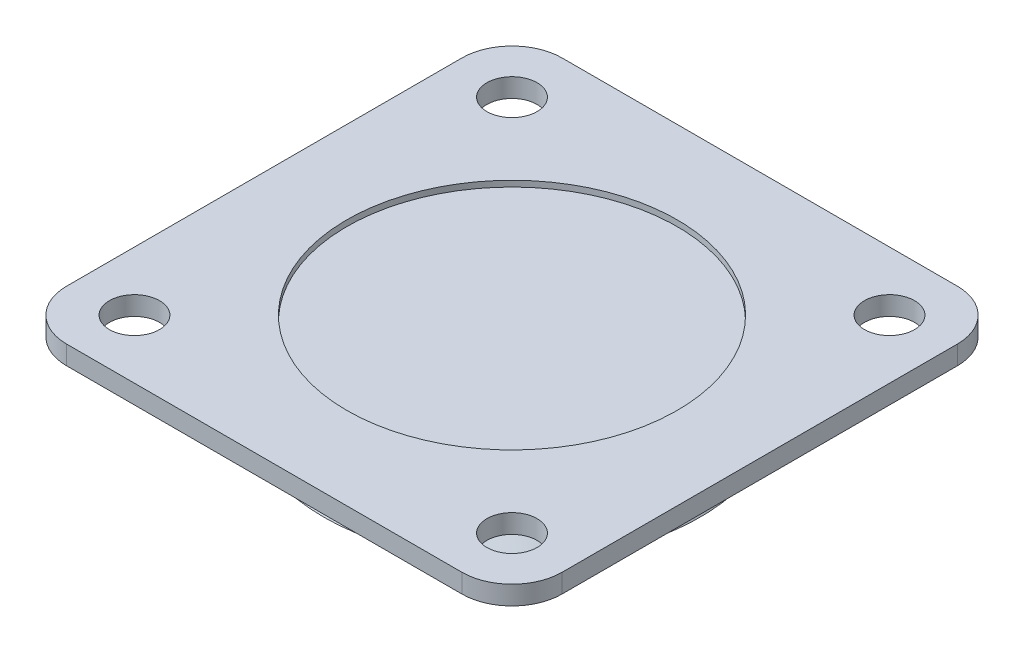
ISO-10303-21;
HEADER;
FILE_DESCRIPTION(('STEP AP214'),'2;1');
FILE_NAME('part.step','',(''),(''),'','','');
FILE_SCHEMA(('AUTOMOTIVE_DESIGN { 1 0 10303 214 1 1 1 1 }'));
ENDSEC;
DATA;
#1=APPLICATION_CONTEXT('core data for automotive mechanical design processes');
#2=APPLICATION_PROTOCOL_DEFINITION('international standard','automotive_design',2000,#1);
#3=PRODUCT_CONTEXT('',#1,'mechanical');
#4=PRODUCT('Part','Part','',(#3));
#5=PRODUCT_RELATED_PRODUCT_CATEGORY('part','',(#4));
#6=PRODUCT_DEFINITION_FORMATION('','',#4);
#7=PRODUCT_DEFINITION_CONTEXT('part definition',#1,'design');
#8=PRODUCT_DEFINITION('design','',#6,#7);
#9=PRODUCT_DEFINITION_SHAPE('','',#8);
#10=(LENGTH_UNIT() NAMED_UNIT(*) SI_UNIT(.MILLI.,.METRE.));
#11=(NAMED_UNIT(*) PLANE_ANGLE_UNIT() SI_UNIT($,.RADIAN.));
#12=(NAMED_UNIT(*) SI_UNIT($,.STERADIAN.) SOLID_ANGLE_UNIT());
#13=UNCERTAINTY_MEASURE_WITH_UNIT(LENGTH_MEASURE(1.E-05),#10,'distance_accuracy_value','');
#14=(GEOMETRIC_REPRESENTATION_CONTEXT(3) GLOBAL_UNCERTAINTY_ASSIGNED_CONTEXT((#13)) GLOBAL_UNIT_ASSIGNED_CONTEXT((#10,
#11,#12)) REPRESENTATION_CONTEXT('',''));
#15=CARTESIAN_POINT('',(0.,0.,0.));
#16=DIRECTION('',(0.,0.,1.));
#17=DIRECTION('',(1.,0.,0.));
#18=AXIS2_PLACEMENT_3D('',#15,#16,#17);
#19=CARTESIAN_POINT('',(-33.5,-3.2,-33.5));
#20=DIRECTION('',(0.,1.,0.));
#21=DIRECTION('',(0.,0.,1.));
#22=AXIS2_PLACEMENT_3D('',#19,#20,#21);
#23=PLANE('',#22);
#24=CARTESIAN_POINT('',(-33.5,-3.2,-33.5));
#25=DIRECTION('',(0.,1.,0.));
#26=DIRECTION('',(0.,0.,1.));
#27=AXIS2_PLACEMENT_3D('',#24,#25,#26);
#28=CIRCLE('',#27,8.50000000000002);
#29=CARTESIAN_POINT('',(-33.5,-3.2,-42.));
#30=VERTEX_POINT('',#29);
#31=CARTESIAN_POINT('',(-42.,-3.2,-33.5));
#32=VERTEX_POINT('',#31);
#33=EDGE_CURVE('E152',#30,#32,#28,.T.);
#34=ORIENTED_EDGE('',*,*,#33,.F.);
#35=DIRECTION('',(-1.,0.,0.));
#36=VECTOR('',#35,1.);
#37=CARTESIAN_POINT('',(33.5,-3.2,-42.));
#38=LINE('',#37,#36);
#39=CARTESIAN_POINT('',(33.5,-3.2,-42.));
#40=VERTEX_POINT('',#39);
#41=EDGE_CURVE('E120',#40,#30,#38,.T.);
#42=ORIENTED_EDGE('',*,*,#41,.F.);
#43=CARTESIAN_POINT('',(33.5,-3.2,-33.5));
#44=DIRECTION('',(0.,1.,0.));
#45=DIRECTION('',(0.,0.,1.));
#46=AXIS2_PLACEMENT_3D('',#43,#44,#45);
#47=CIRCLE('',#46,8.50000000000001);
#48=CARTESIAN_POINT('',(42.,-3.2,-33.5));
#49=VERTEX_POINT('',#48);
#50=EDGE_CURVE('E105',#49,#40,#47,.T.);
#51=ORIENTED_EDGE('',*,*,#50,.F.);
#52=DIRECTION('',(0.,0.,-1.));
#53=VECTOR('',#52,1.);
#54=CARTESIAN_POINT('',(42.,-3.2,33.5));
#55=LINE('',#54,#53);
#56=CARTESIAN_POINT('',(42.,-3.2,33.5));
#57=VERTEX_POINT('',#56);
#58=EDGE_CURVE('E118',#57,#49,#55,.T.);
#59=ORIENTED_EDGE('',*,*,#58,.F.);
#60=CARTESIAN_POINT('',(33.5,-3.2,33.5));
#61=DIRECTION('',(0.,1.,0.));
#62=DIRECTION('',(0.,0.,1.));
#63=AXIS2_PLACEMENT_3D('',#60,#61,#62);
#64=CIRCLE('',#63,8.50000000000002);
#65=CARTESIAN_POINT('',(33.5,-3.2,42.));
#66=VERTEX_POINT('',#65);
#67=EDGE_CURVE('E123',#66,#57,#64,.T.);
#68=ORIENTED_EDGE('',*,*,#67,.F.);
#69=DIRECTION('',(1.,0.,0.));
#70=VECTOR('',#69,1.);
#71=CARTESIAN_POINT('',(-33.5,-3.2,42.));
#72=LINE('',#71,#70);
#73=CARTESIAN_POINT('',(-33.5,-3.2,42.));
#74=VERTEX_POINT('',#73);
#75=EDGE_CURVE('E125',#74,#66,#72,.T.);
#76=ORIENTED_EDGE('',*,*,#75,.F.);
#77=CARTESIAN_POINT('',(-33.5,-3.2,33.5));
#78=DIRECTION('',(0.,1.,0.));
#79=DIRECTION('',(0.,0.,1.));
#80=AXIS2_PLACEMENT_3D('',#77,#78,#79);
#81=CIRCLE('',#80,8.50000000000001);
#82=CARTESIAN_POINT('',(-42.,-3.2,33.5));
#83=VERTEX_POINT('',#82);
#84=EDGE_CURVE('E221',#83,#74,#81,.T.);
#85=ORIENTED_EDGE('',*,*,#84,.F.);
#86=DIRECTION('',(0.,0.,1.));
#87=VECTOR('',#86,1.);
#88=CARTESIAN_POINT('',(-42.,-3.2,-33.5));
#89=LINE('',#88,#87);
#90=EDGE_CURVE('E219',#32,#83,#89,.T.);
#91=ORIENTED_EDGE('',*,*,#90,.F.);
#92=EDGE_LOOP('',(#34,#42,#51,#59,#68,#76,#85,#91));
#93=FACE_BOUND('',#92,.T.);
#94=CARTESIAN_POINT('',(32.,-3.2,32.));
#95=DIRECTION('',(0.,1.,0.));
#96=DIRECTION('',(0.,0.,1.));
#97=AXIS2_PLACEMENT_3D('',#94,#95,#96);
#98=CIRCLE('',#97,4.25);
#99=CARTESIAN_POINT('',(32.,-3.2,36.25));
#100=VERTEX_POINT('',#99);
#101=EDGE_CURVE('E134',#100,#100,#98,.T.);
#102=ORIENTED_EDGE('',*,*,#101,.T.);
#103=EDGE_LOOP('',(#102));
#104=FACE_BOUND('',#103,.T.);
#105=CARTESIAN_POINT('',(32.,-3.2,-32.));
#106=DIRECTION('',(0.,1.,0.));
#107=DIRECTION('',(0.,0.,1.));
#108=AXIS2_PLACEMENT_3D('',#105,#106,#107);
#109=CIRCLE('',#108,4.25);
#110=CARTESIAN_POINT('',(32.,-3.2,-27.75));
#111=VERTEX_POINT('',#110);
#112=EDGE_CURVE('E210',#111,#111,#109,.T.);
#113=ORIENTED_EDGE('',*,*,#112,.T.);
#114=EDGE_LOOP('',(#113));
#115=FACE_BOUND('',#114,.T.);
#116=CARTESIAN_POINT('',(-32.,-3.2,32.));
#117=DIRECTION('',(0.,1.,0.));
#118=DIRECTION('',(0.,0.,1.));
#119=AXIS2_PLACEMENT_3D('',#116,#117,#118);
#120=CIRCLE('',#119,4.25);
#121=CARTESIAN_POINT('',(-32.,-3.2,36.25));
#122=VERTEX_POINT('',#121);
#123=EDGE_CURVE('E378',#122,#122,#120,.T.);
#124=ORIENTED_EDGE('',*,*,#123,.T.);
#125=EDGE_LOOP('',(#124));
#126=FACE_BOUND('',#125,.T.);
#127=CARTESIAN_POINT('',(-32.,-3.2,-32.));
#128=DIRECTION('',(0.,1.,0.));
#129=DIRECTION('',(0.,0.,1.));
#130=AXIS2_PLACEMENT_3D('',#127,#128,#129);
#131=CIRCLE('',#130,4.25);
#132=CARTESIAN_POINT('',(-32.,-3.2,-27.75));
#133=VERTEX_POINT('',#132);
#134=EDGE_CURVE('E374',#133,#133,#131,.T.);
#135=ORIENTED_EDGE('',*,*,#134,.T.);
#136=EDGE_LOOP('',(#135));
#137=FACE_BOUND('',#136,.T.);
#138=CARTESIAN_POINT('',(0.,-3.2,0.));
#139=DIRECTION('',(0.,1.,0.));
#140=DIRECTION('',(0.,0.,1.));
#141=AXIS2_PLACEMENT_3D('',#138,#139,#140);
#142=CIRCLE('',#141,31.92);
#143=CARTESIAN_POINT('',(0.,-3.2,31.92));
#144=VERTEX_POINT('',#143);
#145=EDGE_CURVE('E11',#144,#144,#142,.F.);
#146=ORIENTED_EDGE('',*,*,#145,.F.);
#147=EDGE_LOOP('',(#146));
#148=FACE_BOUND('',#147,.T.);
#149=ADVANCED_FACE('F31',(#93,#104,#115,#126,#137,#148),#23,.F.);
#150=CARTESIAN_POINT('',(-33.5,-3.2,-33.5));
#151=DIRECTION('',(0.,1.,0.));
#152=DIRECTION('',(0.,0.,1.));
#153=AXIS2_PLACEMENT_3D('',#150,#151,#152);
#154=CYLINDRICAL_SURFACE('',#153,8.50000000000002);
#155=CARTESIAN_POINT('',(-33.5,0.,-33.5));
#156=DIRECTION('',(0.,1.,0.));
#157=DIRECTION('',(0.,0.,1.));
#158=AXIS2_PLACEMENT_3D('',#155,#156,#157);
#159=CIRCLE('',#158,8.50000000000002);
#160=CARTESIAN_POINT('',(-33.5,0.,-42.));
#161=VERTEX_POINT('',#160);
#162=CARTESIAN_POINT('',(-42.,0.,-33.5));
#163=VERTEX_POINT('',#162);
#164=EDGE_CURVE('E130',#161,#163,#159,.T.);
#165=ORIENTED_EDGE('',*,*,#164,.F.);
#166=DIRECTION('',(0.,1.,0.));
#167=VECTOR('',#166,1.);
#168=CARTESIAN_POINT('',(-33.5,-3.2,-42.));
#169=LINE('',#168,#167);
#170=EDGE_CURVE('E40',#30,#161,#169,.T.);
#171=ORIENTED_EDGE('',*,*,#170,.F.);
#172=ORIENTED_EDGE('',*,*,#33,.T.);
#173=DIRECTION('',(0.,1.,0.));
#174=VECTOR('',#173,1.);
#175=CARTESIAN_POINT('',(-42.,-3.2,-33.5));
#176=LINE('',#175,#174);
#177=EDGE_CURVE('E88',#32,#163,#176,.T.);
#178=ORIENTED_EDGE('',*,*,#177,.T.);
#179=EDGE_LOOP('',(#165,#171,#172,#178));
#180=FACE_BOUND('',#179,.T.);
#181=ADVANCED_FACE('F33',(#180),#154,.T.);
#182=CARTESIAN_POINT('',(33.5,-3.2,-42.));
#183=DIRECTION('',(0.,0.,-1.));
#184=DIRECTION('',(-1.,0.,0.));
#185=AXIS2_PLACEMENT_3D('',#182,#183,#184);
#186=PLANE('',#185);
#187=DIRECTION('',(-1.,0.,0.));
#188=VECTOR('',#187,1.);
#189=CARTESIAN_POINT('',(33.5,0.,-42.));
#190=LINE('',#189,#188);
#191=CARTESIAN_POINT('',(33.5,0.,-42.));
#192=VERTEX_POINT('',#191);
#193=EDGE_CURVE('E149',#192,#161,#190,.T.);
#194=ORIENTED_EDGE('',*,*,#193,.F.);
#195=DIRECTION('',(0.,1.,0.));
#196=VECTOR('',#195,1.);
#197=CARTESIAN_POINT('',(33.5,-3.2,-42.));
#198=LINE('',#197,#196);
#199=EDGE_CURVE('E76',#40,#192,#198,.T.);
#200=ORIENTED_EDGE('',*,*,#199,.F.);
#201=ORIENTED_EDGE('',*,*,#41,.T.);
#202=ORIENTED_EDGE('',*,*,#170,.T.);
#203=EDGE_LOOP('',(#194,#200,#201,#202));
#204=FACE_BOUND('',#203,.T.);
#205=ADVANCED_FACE('F165',(#204),#186,.T.);
#206=CARTESIAN_POINT('',(33.5,-3.2,-33.5));
#207=DIRECTION('',(0.,1.,0.));
#208=DIRECTION('',(0.,0.,1.));
#209=AXIS2_PLACEMENT_3D('',#206,#207,#208);
#210=CYLINDRICAL_SURFACE('',#209,8.50000000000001);
#211=CARTESIAN_POINT('',(33.5,0.,-33.5));
#212=DIRECTION('',(0.,1.,0.));
#213=DIRECTION('',(0.,0.,1.));
#214=AXIS2_PLACEMENT_3D('',#211,#212,#213);
#215=CIRCLE('',#214,8.50000000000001);
#216=CARTESIAN_POINT('',(42.,0.,-33.5));
#217=VERTEX_POINT('',#216);
#218=EDGE_CURVE('E107',#217,#192,#215,.T.);
#219=ORIENTED_EDGE('',*,*,#218,.F.);
#220=DIRECTION('',(0.,1.,0.));
#221=VECTOR('',#220,1.);
#222=CARTESIAN_POINT('',(42.,-3.2,-33.5));
#223=LINE('',#222,#221);
#224=EDGE_CURVE('E102',#49,#217,#223,.T.);
#225=ORIENTED_EDGE('',*,*,#224,.F.);
#226=ORIENTED_EDGE('',*,*,#50,.T.);
#227=ORIENTED_EDGE('',*,*,#199,.T.);
#228=EDGE_LOOP('',(#219,#225,#226,#227));
#229=FACE_BOUND('',#228,.T.);
#230=ADVANCED_FACE('F104',(#229),#210,.T.);
#231=CARTESIAN_POINT('',(42.,-3.2,33.5));
#232=DIRECTION('',(1.,0.,0.));
#233=DIRECTION('',(0.,0.,-1.));
#234=AXIS2_PLACEMENT_3D('',#231,#232,#233);
#235=PLANE('',#234);
#236=DIRECTION('',(0.,0.,-1.));
#237=VECTOR('',#236,1.);
#238=CARTESIAN_POINT('',(42.,0.,33.5));
#239=LINE('',#238,#237);
#240=CARTESIAN_POINT('',(42.,0.,33.5));
#241=VERTEX_POINT('',#240);
#242=EDGE_CURVE('E146',#241,#217,#239,.T.);
#243=ORIENTED_EDGE('',*,*,#242,.F.);
#244=DIRECTION('',(0.,1.,0.));
#245=VECTOR('',#244,1.);
#246=CARTESIAN_POINT('',(42.,-3.2,33.5));
#247=LINE('',#246,#245);
#248=EDGE_CURVE('E112',#57,#241,#247,.T.);
#249=ORIENTED_EDGE('',*,*,#248,.F.);
#250=ORIENTED_EDGE('',*,*,#58,.T.);
#251=ORIENTED_EDGE('',*,*,#224,.T.);
#252=EDGE_LOOP('',(#243,#249,#250,#251));
#253=FACE_BOUND('',#252,.T.);
#254=ADVANCED_FACE('F122',(#253),#235,.T.);
#255=CARTESIAN_POINT('',(33.5,-3.2,33.5));
#256=DIRECTION('',(0.,1.,0.));
#257=DIRECTION('',(0.,0.,1.));
#258=AXIS2_PLACEMENT_3D('',#255,#256,#257);
#259=CYLINDRICAL_SURFACE('',#258,8.50000000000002);
#260=CARTESIAN_POINT('',(33.5,0.,33.5));
#261=DIRECTION('',(0.,1.,0.));
#262=DIRECTION('',(0.,0.,1.));
#263=AXIS2_PLACEMENT_3D('',#260,#261,#262);
#264=CIRCLE('',#263,8.50000000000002);
#265=CARTESIAN_POINT('',(33.5,0.,42.));
#266=VERTEX_POINT('',#265);
#267=EDGE_CURVE('E143',#266,#241,#264,.T.);
#268=ORIENTED_EDGE('',*,*,#267,.F.);
#269=DIRECTION('',(0.,1.,0.));
#270=VECTOR('',#269,1.);
#271=CARTESIAN_POINT('',(33.5,-3.2,42.));
#272=LINE('',#271,#270);
#273=EDGE_CURVE('E156',#66,#266,#272,.T.);
#274=ORIENTED_EDGE('',*,*,#273,.F.);
#275=ORIENTED_EDGE('',*,*,#67,.T.);
#276=ORIENTED_EDGE('',*,*,#248,.T.);
#277=EDGE_LOOP('',(#268,#274,#275,#276));
#278=FACE_BOUND('',#277,.T.);
#279=ADVANCED_FACE('F232',(#278),#259,.T.);
#280=CARTESIAN_POINT('',(-33.5,-3.2,42.));
#281=DIRECTION('',(0.,0.,1.));
#282=DIRECTION('',(1.,0.,0.));
#283=AXIS2_PLACEMENT_3D('',#280,#281,#282);
#284=PLANE('',#283);
#285=DIRECTION('',(1.,0.,0.));
#286=VECTOR('',#285,1.);
#287=CARTESIAN_POINT('',(-33.5,0.,42.));
#288=LINE('',#287,#286);
#289=CARTESIAN_POINT('',(-33.5,0.,42.));
#290=VERTEX_POINT('',#289);
#291=EDGE_CURVE('E140',#290,#266,#288,.T.);
#292=ORIENTED_EDGE('',*,*,#291,.F.);
#293=DIRECTION('',(0.,1.,0.));
#294=VECTOR('',#293,1.);
#295=CARTESIAN_POINT('',(-33.5,-3.2,42.));
#296=LINE('',#295,#294);
#297=EDGE_CURVE('E158',#74,#290,#296,.T.);
#298=ORIENTED_EDGE('',*,*,#297,.F.);
#299=ORIENTED_EDGE('',*,*,#75,.T.);
#300=ORIENTED_EDGE('',*,*,#273,.T.);
#301=EDGE_LOOP('',(#292,#298,#299,#300));
#302=FACE_BOUND('',#301,.T.);
#303=ADVANCED_FACE('F227',(#302),#284,.T.);
#304=CARTESIAN_POINT('',(-33.5,-3.2,33.5));
#305=DIRECTION('',(0.,1.,0.));
#306=DIRECTION('',(0.,0.,1.));
#307=AXIS2_PLACEMENT_3D('',#304,#305,#306);
#308=CYLINDRICAL_SURFACE('',#307,8.50000000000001);
#309=CARTESIAN_POINT('',(-33.5,0.,33.5));
#310=DIRECTION('',(0.,1.,0.));
#311=DIRECTION('',(0.,0.,1.));
#312=AXIS2_PLACEMENT_3D('',#309,#310,#311);
#313=CIRCLE('',#312,8.50000000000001);
#314=CARTESIAN_POINT('',(-42.,0.,33.5));
#315=VERTEX_POINT('',#314);
#316=EDGE_CURVE('E137',#315,#290,#313,.T.);
#317=ORIENTED_EDGE('',*,*,#316,.F.);
#318=DIRECTION('',(0.,1.,0.));
#319=VECTOR('',#318,1.);
#320=CARTESIAN_POINT('',(-42.,-3.2,33.5));
#321=LINE('',#320,#319);
#322=EDGE_CURVE('E160',#83,#315,#321,.T.);
#323=ORIENTED_EDGE('',*,*,#322,.F.);
#324=ORIENTED_EDGE('',*,*,#84,.T.);
#325=ORIENTED_EDGE('',*,*,#297,.T.);
#326=EDGE_LOOP('',(#317,#323,#324,#325));
#327=FACE_BOUND('',#326,.T.);
#328=ADVANCED_FACE('F189',(#327),#308,.T.);
#329=CARTESIAN_POINT('',(-42.,-3.2,-33.5));
#330=DIRECTION('',(-1.,0.,0.));
#331=DIRECTION('',(0.,0.,1.));
#332=AXIS2_PLACEMENT_3D('',#329,#330,#331);
#333=PLANE('',#332);
#334=DIRECTION('',(0.,0.,1.));
#335=VECTOR('',#334,1.);
#336=CARTESIAN_POINT('',(-42.,0.,-33.5));
#337=LINE('',#336,#335);
#338=EDGE_CURVE('E133',#163,#315,#337,.T.);
#339=ORIENTED_EDGE('',*,*,#338,.F.);
#340=ORIENTED_EDGE('',*,*,#177,.F.);
#341=ORIENTED_EDGE('',*,*,#90,.T.);
#342=ORIENTED_EDGE('',*,*,#322,.T.);
#343=EDGE_LOOP('',(#339,#340,#341,#342));
#344=FACE_BOUND('',#343,.T.);
#345=ADVANCED_FACE('F161',(#344),#333,.T.);
#346=CARTESIAN_POINT('',(-33.5,0.,-33.5));
#347=DIRECTION('',(0.,1.,0.));
#348=DIRECTION('',(0.,0.,1.));
#349=AXIS2_PLACEMENT_3D('',#346,#347,#348);
#350=PLANE('',#349);
#351=CARTESIAN_POINT('',(0.,0.,0.));
#352=DIRECTION('',(0.,1.,0.));
#353=DIRECTION('',(0.,0.,1.));
#354=AXIS2_PLACEMENT_3D('',#351,#352,#353);
#355=CIRCLE('',#354,28.);
#356=CARTESIAN_POINT('',(0.,0.,28.));
#357=VERTEX_POINT('',#356);
#358=EDGE_CURVE('E193',#357,#357,#355,.T.);
#359=ORIENTED_EDGE('',*,*,#358,.F.);
#360=EDGE_LOOP('',(#359));
#361=FACE_BOUND('',#360,.T.);
#362=CARTESIAN_POINT('',(-32.,0.,-32.));
#363=DIRECTION('',(0.,1.,0.));
#364=DIRECTION('',(0.,0.,1.));
#365=AXIS2_PLACEMENT_3D('',#362,#363,#364);
#366=CIRCLE('',#365,4.25);
#367=CARTESIAN_POINT('',(-32.,0.,-27.75));
#368=VERTEX_POINT('',#367);
#369=EDGE_CURVE('E197',#368,#368,#366,.T.);
#370=ORIENTED_EDGE('',*,*,#369,.F.);
#371=EDGE_LOOP('',(#370));
#372=FACE_BOUND('',#371,.T.);
#373=CARTESIAN_POINT('',(-32.,0.,32.));
#374=DIRECTION('',(0.,1.,0.));
#375=DIRECTION('',(0.,0.,1.));
#376=AXIS2_PLACEMENT_3D('',#373,#374,#375);
#377=CIRCLE('',#376,4.25);
#378=CARTESIAN_POINT('',(-32.,0.,36.25));
#379=VERTEX_POINT('',#378);
#380=EDGE_CURVE('E201',#379,#379,#377,.T.);
#381=ORIENTED_EDGE('',*,*,#380,.F.);
#382=EDGE_LOOP('',(#381));
#383=FACE_BOUND('',#382,.T.);
#384=CARTESIAN_POINT('',(32.,0.,-32.));
#385=DIRECTION('',(0.,1.,0.));
#386=DIRECTION('',(0.,0.,1.));
#387=AXIS2_PLACEMENT_3D('',#384,#385,#386);
#388=CIRCLE('',#387,4.25);
#389=CARTESIAN_POINT('',(32.,0.,-27.75));
#390=VERTEX_POINT('',#389);
#391=EDGE_CURVE('E205',#390,#390,#388,.T.);
#392=ORIENTED_EDGE('',*,*,#391,.F.);
#393=EDGE_LOOP('',(#392));
#394=FACE_BOUND('',#393,.T.);
#395=CARTESIAN_POINT('',(32.,0.,32.));
#396=DIRECTION('',(0.,1.,0.));
#397=DIRECTION('',(0.,0.,1.));
#398=AXIS2_PLACEMENT_3D('',#395,#396,#397);
#399=CIRCLE('',#398,4.25);
#400=CARTESIAN_POINT('',(32.,0.,36.25));
#401=VERTEX_POINT('',#400);
#402=EDGE_CURVE('E208',#401,#401,#399,.T.);
#403=ORIENTED_EDGE('',*,*,#402,.F.);
#404=EDGE_LOOP('',(#403));
#405=FACE_BOUND('',#404,.T.);
#406=ORIENTED_EDGE('',*,*,#164,.T.);
#407=ORIENTED_EDGE('',*,*,#338,.T.);
#408=ORIENTED_EDGE('',*,*,#316,.T.);
#409=ORIENTED_EDGE('',*,*,#291,.T.);
#410=ORIENTED_EDGE('',*,*,#267,.T.);
#411=ORIENTED_EDGE('',*,*,#242,.T.);
#412=ORIENTED_EDGE('',*,*,#218,.T.);
#413=ORIENTED_EDGE('',*,*,#193,.T.);
#414=EDGE_LOOP('',(#406,#407,#408,#409,#410,#411,#412,#413));
#415=FACE_BOUND('',#414,.T.);
#416=ADVANCED_FACE('F164',(#361,#372,#383,#394,#405,#415),#350,.T.);
#417=CARTESIAN_POINT('',(32.,-3.2,32.));
#418=DIRECTION('',(0.,1.,0.));
#419=DIRECTION('',(0.,0.,1.));
#420=AXIS2_PLACEMENT_3D('',#417,#418,#419);
#421=CYLINDRICAL_SURFACE('',#420,4.25);
#422=ORIENTED_EDGE('',*,*,#101,.F.);
#423=EDGE_LOOP('',(#422));
#424=FACE_BOUND('',#423,.T.);
#425=ORIENTED_EDGE('',*,*,#402,.T.);
#426=EDGE_LOOP('',(#425));
#427=FACE_BOUND('',#426,.T.);
#428=ADVANCED_FACE('F179',(#424,#427),#421,.F.);
#429=CARTESIAN_POINT('',(32.,-3.2,-32.));
#430=DIRECTION('',(0.,1.,0.));
#431=DIRECTION('',(0.,0.,1.));
#432=AXIS2_PLACEMENT_3D('',#429,#430,#431);
#433=CYLINDRICAL_SURFACE('',#432,4.25);
#434=ORIENTED_EDGE('',*,*,#112,.F.);
#435=EDGE_LOOP('',(#434));
#436=FACE_BOUND('',#435,.T.);
#437=ORIENTED_EDGE('',*,*,#391,.T.);
#438=EDGE_LOOP('',(#437));
#439=FACE_BOUND('',#438,.T.);
#440=ADVANCED_FACE('F187',(#436,#439),#433,.F.);
#441=CARTESIAN_POINT('',(-32.,-3.2,32.));
#442=DIRECTION('',(0.,1.,0.));
#443=DIRECTION('',(0.,0.,1.));
#444=AXIS2_PLACEMENT_3D('',#441,#442,#443);
#445=CYLINDRICAL_SURFACE('',#444,4.25);
#446=ORIENTED_EDGE('',*,*,#123,.F.);
#447=EDGE_LOOP('',(#446));
#448=FACE_BOUND('',#447,.T.);
#449=ORIENTED_EDGE('',*,*,#380,.T.);
#450=EDGE_LOOP('',(#449));
#451=FACE_BOUND('',#450,.T.);
#452=ADVANCED_FACE('F267',(#448,#451),#445,.F.);
#453=CARTESIAN_POINT('',(-32.,-3.2,-32.));
#454=DIRECTION('',(0.,1.,0.));
#455=DIRECTION('',(0.,0.,1.));
#456=AXIS2_PLACEMENT_3D('',#453,#454,#455);
#457=CYLINDRICAL_SURFACE('',#456,4.25);
#458=ORIENTED_EDGE('',*,*,#134,.F.);
#459=EDGE_LOOP('',(#458));
#460=FACE_BOUND('',#459,.T.);
#461=ORIENTED_EDGE('',*,*,#369,.T.);
#462=EDGE_LOOP('',(#461));
#463=FACE_BOUND('',#462,.T.);
#464=ADVANCED_FACE('F276',(#460,#463),#457,.F.);
#465=CARTESIAN_POINT('',(0.,-1.,0.));
#466=DIRECTION('',(0.,1.,0.));
#467=DIRECTION('',(0.,0.,1.));
#468=AXIS2_PLACEMENT_3D('',#465,#466,#467);
#469=CYLINDRICAL_SURFACE('',#468,28.);
#470=CARTESIAN_POINT('',(0.,-1.,0.));
#471=DIRECTION('',(0.,1.,0.));
#472=DIRECTION('',(0.,0.,1.));
#473=AXIS2_PLACEMENT_3D('',#470,#471,#472);
#474=CIRCLE('',#473,28.);
#475=CARTESIAN_POINT('',(0.,-1.,28.));
#476=VERTEX_POINT('',#475);
#477=EDGE_CURVE('E370',#476,#476,#474,.T.);
#478=ORIENTED_EDGE('',*,*,#477,.F.);
#479=EDGE_LOOP('',(#478));
#480=FACE_BOUND('',#479,.T.);
#481=ORIENTED_EDGE('',*,*,#358,.T.);
#482=EDGE_LOOP('',(#481));
#483=FACE_BOUND('',#482,.T.);
#484=ADVANCED_FACE('F285',(#480,#483),#469,.F.);
#485=CARTESIAN_POINT('',(0.,-1.,0.));
#486=DIRECTION('',(0.,1.,0.));
#487=DIRECTION('',(0.,0.,1.));
#488=AXIS2_PLACEMENT_3D('',#485,#486,#487);
#489=PLANE('',#488);
#490=ORIENTED_EDGE('',*,*,#477,.T.);
#491=EDGE_LOOP('',(#490));
#492=FACE_BOUND('',#491,.T.);
#493=ADVANCED_FACE('F299',(#492),#489,.T.);
#494=CARTESIAN_POINT('',(31.92,-13.7,0.));
#495=DIRECTION('',(0.,1.,0.));
#496=DIRECTION('',(0.,0.,1.));
#497=AXIS2_PLACEMENT_3D('',#494,#495,#496);
#498=PLANE('',#497);
#499=CARTESIAN_POINT('',(0.,-13.7,0.));
#500=DIRECTION('',(0.,1.,0.));
#501=DIRECTION('',(0.,0.,1.));
#502=AXIS2_PLACEMENT_3D('',#499,#500,#501);
#503=CIRCLE('',#502,31.92);
#504=CARTESIAN_POINT('',(0.,-13.7,31.92));
#505=VERTEX_POINT('',#504);
#506=EDGE_CURVE('E365',#505,#505,#503,.T.);
#507=ORIENTED_EDGE('',*,*,#506,.F.);
#508=EDGE_LOOP('',(#507));
#509=FACE_BOUND('',#508,.T.);
#510=ADVANCED_FACE('F308',(#509),#498,.F.);
#511=CARTESIAN_POINT('',(0.,-13.7,0.));
#512=DIRECTION('',(0.,-1.,0.));
#513=DIRECTION('',(0.,0.,-1.));
#514=AXIS2_PLACEMENT_3D('',#511,#512,#513);
#515=CONICAL_SURFACE('',#514,31.92,0.674740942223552);
#516=CARTESIAN_POINT('',(0.,-9.69939009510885,0.));
#517=DIRECTION('',(0.,1.,0.));
#518=DIRECTION('',(0.,0.,1.));
#519=AXIS2_PLACEMENT_3D('',#516,#517,#518);
#520=CIRCLE('',#519,28.7195120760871);
#521=CARTESIAN_POINT('',(0.,-9.69939009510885,28.7195120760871));
#522=VERTEX_POINT('',#521);
#523=EDGE_CURVE('E362',#522,#522,#520,.T.);
#524=ORIENTED_EDGE('',*,*,#523,.F.);
#525=EDGE_LOOP('',(#524));
#526=FACE_BOUND('',#525,.T.);
#527=ORIENTED_EDGE('',*,*,#506,.T.);
#528=EDGE_LOOP('',(#527));
#529=FACE_BOUND('',#528,.T.);
#530=ADVANCED_FACE('F323',(#526,#529),#515,.T.);
#531=CARTESIAN_POINT('',(0.,-8.45,0.));
#532=DIRECTION('',(0.,1.,0.));
#533=DIRECTION('',(0.,0.,1.));
#534=AXIS2_PLACEMENT_3D('',#531,#532,#533);
#535=TOROIDAL_SURFACE('',#534,30.2812496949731,1.99999999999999);
#536=CARTESIAN_POINT('',(0.,-7.20060990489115,0.));
#537=DIRECTION('',(0.,1.,0.));
#538=DIRECTION('',(0.,0.,1.));
#539=AXIS2_PLACEMENT_3D('',#536,#537,#538);
#540=CIRCLE('',#539,28.7195120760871);
#541=CARTESIAN_POINT('',(0.,-7.20060990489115,28.7195120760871));
#542=VERTEX_POINT('',#541);
#543=EDGE_CURVE('E361',#542,#542,#540,.T.);
#544=ORIENTED_EDGE('',*,*,#543,.F.);
#545=EDGE_LOOP('',(#544));
#546=FACE_BOUND('',#545,.T.);
#547=ORIENTED_EDGE('',*,*,#523,.T.);
#548=EDGE_LOOP('',(#547));
#549=FACE_BOUND('',#548,.T.);
#550=ADVANCED_FACE('F333',(#546,#549),#535,.F.);
#551=CARTESIAN_POINT('',(0.,-7.20060990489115,0.));
#552=DIRECTION('',(0.,1.,0.));
#553=DIRECTION('',(0.,0.,1.));
#554=AXIS2_PLACEMENT_3D('',#551,#552,#553);
#555=CONICAL_SURFACE('',#554,28.7195120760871,0.674740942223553);
#556=ORIENTED_EDGE('',*,*,#145,.T.);
#557=EDGE_LOOP('',(#556));
#558=FACE_BOUND('',#557,.T.);
#559=ORIENTED_EDGE('',*,*,#543,.T.);
#560=EDGE_LOOP('',(#559));
#561=FACE_BOUND('',#560,.T.);
#562=ADVANCED_FACE('F343',(#558,#561),#555,.T.);
#563=CLOSED_SHELL('',(#149,#181,#205,#230,#254,#279,#303,#328,#345,#416,#428,#440,#452,#464,
#484,#493,#510,#530,#550,#562));
#564=MANIFOLD_SOLID_BREP('B2',#563);
#565=ADVANCED_BREP_SHAPE_REPRESENTATION('',(#18,#564),#14);
#566=SHAPE_DEFINITION_REPRESENTATION(#9,#565);
ENDSEC;
END-ISO-10303-21;
